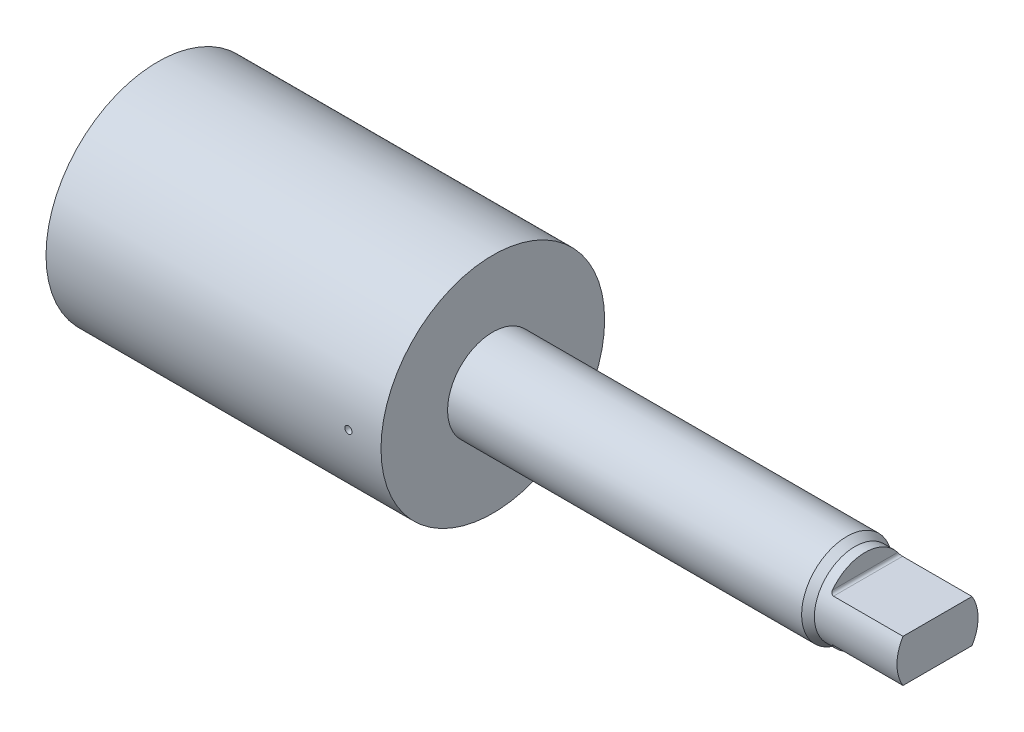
ISO-10303-21;
HEADER;
FILE_DESCRIPTION(('STEP AP214'),'2;1');
FILE_NAME('part.step','',(''),(''),'','','');
FILE_SCHEMA(('AUTOMOTIVE_DESIGN { 1 0 10303 214 1 1 1 1 }'));
ENDSEC;
DATA;
#1=APPLICATION_CONTEXT('core data for automotive mechanical design processes');
#2=APPLICATION_PROTOCOL_DEFINITION('international standard','automotive_design',2000,#1);
#3=PRODUCT_CONTEXT('',#1,'mechanical');
#4=PRODUCT('Part','Part','',(#3));
#5=PRODUCT_RELATED_PRODUCT_CATEGORY('part','',(#4));
#6=PRODUCT_DEFINITION_FORMATION('','',#4);
#7=PRODUCT_DEFINITION_CONTEXT('part definition',#1,'design');
#8=PRODUCT_DEFINITION('design','',#6,#7);
#9=PRODUCT_DEFINITION_SHAPE('','',#8);
#10=(LENGTH_UNIT() NAMED_UNIT(*) SI_UNIT(.MILLI.,.METRE.));
#11=(NAMED_UNIT(*) PLANE_ANGLE_UNIT() SI_UNIT($,.RADIAN.));
#12=(NAMED_UNIT(*) SI_UNIT($,.STERADIAN.) SOLID_ANGLE_UNIT());
#13=UNCERTAINTY_MEASURE_WITH_UNIT(LENGTH_MEASURE(1.E-05),#10,'distance_accuracy_value','');
#14=(GEOMETRIC_REPRESENTATION_CONTEXT(3) GLOBAL_UNCERTAINTY_ASSIGNED_CONTEXT((#13)) GLOBAL_UNIT_ASSIGNED_CONTEXT((#10,
#11,#12)) REPRESENTATION_CONTEXT('',''));
#15=CARTESIAN_POINT('',(0.,0.,0.));
#16=DIRECTION('',(0.,0.,1.));
#17=DIRECTION('',(1.,0.,0.));
#18=AXIS2_PLACEMENT_3D('',#15,#16,#17);
#19=CARTESIAN_POINT('',(26.83,5.9944,0.));
#20=DIRECTION('',(1.,0.,0.));
#21=DIRECTION('',(0.,0.,-1.));
#22=AXIS2_PLACEMENT_3D('',#19,#20,#21);
#23=PLANE('',#22);
#24=CARTESIAN_POINT('',(26.83,0.,0.));
#25=DIRECTION('',(-1.,0.,0.));
#26=DIRECTION('',(0.,0.,1.));
#27=AXIS2_PLACEMENT_3D('',#24,#25,#26);
#28=CIRCLE('',#27,5.9944);
#29=CARTESIAN_POINT('',(26.83,0.,5.9944));
#30=VERTEX_POINT('',#29);
#31=EDGE_CURVE('E148',#30,#30,#28,.T.);
#32=ORIENTED_EDGE('',*,*,#31,.T.);
#33=EDGE_LOOP('',(#32));
#34=FACE_BOUND('',#33,.T.);
#35=ADVANCED_FACE('F36',(#34),#23,.F.);
#36=CARTESIAN_POINT('',(-2.97183620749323,0.,0.));
#37=DIRECTION('',(-1.,0.,0.));
#38=DIRECTION('',(0.,0.,1.));
#39=AXIS2_PLACEMENT_3D('',#36,#37,#38);
#40=CYLINDRICAL_SURFACE('',#39,5.9944);
#41=ORIENTED_EDGE('',*,*,#31,.F.);
#42=CARTESIAN_POINT('',(26.83,0.,5.9944));
#43=CARTESIAN_POINT('',(26.8299992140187,0.0178207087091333,5.99439988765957));
#44=CARTESIAN_POINT('',(26.8284945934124,0.0356540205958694,5.99431968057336));
#45=CARTESIAN_POINT('',(26.8225137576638,0.0708285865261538,5.9940074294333));
#46=CARTESIAN_POINT('',(26.818034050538,0.0881692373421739,5.99377520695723));
#47=CARTESIAN_POINT('',(26.8062317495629,0.121843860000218,5.99318520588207));
#48=CARTESIAN_POINT('',(26.7989106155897,0.138178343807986,5.99282749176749));
#49=CARTESIAN_POINT('',(26.7816355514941,0.169382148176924,5.99202678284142));
#50=CARTESIAN_POINT('',(26.7716822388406,0.184251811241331,5.99158380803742));
#51=CARTESIAN_POINT('',(26.7494130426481,0.212124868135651,5.99066184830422));
#52=CARTESIAN_POINT('',(26.7370948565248,0.225126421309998,5.99018282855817));
#53=CARTESIAN_POINT('',(26.7104502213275,0.248878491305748,5.98924306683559));
#54=CARTESIAN_POINT('',(26.6961236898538,0.259628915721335,5.98878232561));
#55=CARTESIAN_POINT('',(26.6658591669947,0.27857880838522,5.98793082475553));
#56=CARTESIAN_POINT('',(26.6499202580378,0.286776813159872,5.98754010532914));
#57=CARTESIAN_POINT('',(26.6168898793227,0.300379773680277,5.98687314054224));
#58=CARTESIAN_POINT('',(26.5997984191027,0.305784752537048,5.98659689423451));
#59=CARTESIAN_POINT('',(26.5649652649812,0.313643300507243,5.98619034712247));
#60=CARTESIAN_POINT('',(26.5472242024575,0.316099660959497,5.98605990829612));
#61=CARTESIAN_POINT('',(26.5115811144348,0.317999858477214,5.98595927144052));
#62=CARTESIAN_POINT('',(26.4936790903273,0.317443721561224,5.98598907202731));
#63=CARTESIAN_POINT('',(26.4582412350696,0.313337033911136,5.98620542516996));
#64=CARTESIAN_POINT('',(26.4407050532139,0.309789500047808,5.98639181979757));
#65=CARTESIAN_POINT('',(26.4064774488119,0.299805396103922,5.986900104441));
#66=CARTESIAN_POINT('',(26.3897860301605,0.293368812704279,5.98722199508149));
#67=CARTESIAN_POINT('',(26.3577120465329,0.277785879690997,5.98796517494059));
#68=CARTESIAN_POINT('',(26.3423301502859,0.26863815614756,5.98838651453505));
#69=CARTESIAN_POINT('',(26.3133191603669,0.247893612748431,5.98928105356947));
#70=CARTESIAN_POINT('',(26.2996900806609,0.236296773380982,5.98975425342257));
#71=CARTESIAN_POINT('',(26.2745540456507,0.210966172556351,5.99069988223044));
#72=CARTESIAN_POINT('',(26.2630497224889,0.197229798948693,5.99117230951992));
#73=CARTESIAN_POINT('',(26.2425100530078,0.168019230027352,5.99206258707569));
#74=CARTESIAN_POINT('',(26.2334747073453,0.152545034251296,5.99248043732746));
#75=CARTESIAN_POINT('',(26.2181297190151,0.120296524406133,5.99321449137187));
#76=CARTESIAN_POINT('',(26.2118201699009,0.103522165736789,5.99353069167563));
#77=CARTESIAN_POINT('',(26.2021076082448,0.0691501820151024,5.9940257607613));
#78=CARTESIAN_POINT('',(26.1987045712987,0.0515525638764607,5.99420463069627));
#79=CARTESIAN_POINT('',(26.1949048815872,0.0160564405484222,5.99440473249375));
#80=CARTESIAN_POINT('',(26.1945045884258,-0.00184167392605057,5.99442615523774));
#81=CARTESIAN_POINT('',(26.1967122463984,-0.037450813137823,5.9943094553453));
#82=CARTESIAN_POINT('',(26.199320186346,-0.0551618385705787,5.99417133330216));
#83=CARTESIAN_POINT('',(26.2074672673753,-0.0898838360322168,5.9937512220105));
#84=CARTESIAN_POINT('',(26.2130047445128,-0.106895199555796,5.99346931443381));
#85=CARTESIAN_POINT('',(26.2268520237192,-0.139747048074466,5.9927933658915));
#86=CARTESIAN_POINT('',(26.2351618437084,-0.155587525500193,5.99239932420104));
#87=CARTESIAN_POINT('',(26.2543272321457,-0.185664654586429,5.99154294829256));
#88=CARTESIAN_POINT('',(26.2651852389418,-0.1998997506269,5.99108054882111));
#89=CARTESIAN_POINT('',(26.2891352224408,-0.226346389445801,5.99013974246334));
#90=CARTESIAN_POINT('',(26.3022272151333,-0.238557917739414,5.98966133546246));
#91=CARTESIAN_POINT('',(26.3302892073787,-0.26062305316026,5.98874188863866));
#92=CARTESIAN_POINT('',(26.3452610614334,-0.270474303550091,5.98830088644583));
#93=CARTESIAN_POINT('',(26.3766484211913,-0.287523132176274,5.98750657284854));
#94=CARTESIAN_POINT('',(26.3930639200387,-0.294720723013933,5.98715326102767));
#95=CARTESIAN_POINT('',(26.4268638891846,-0.306253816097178,5.98657443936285));
#96=CARTESIAN_POINT('',(26.4442478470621,-0.31059081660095,5.98634886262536));
#97=CARTESIAN_POINT('',(26.4794984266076,-0.316284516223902,5.98605076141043));
#98=CARTESIAN_POINT('',(26.4973650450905,-0.317641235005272,5.98597823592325));
#99=CARTESIAN_POINT('',(26.5330503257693,-0.3173356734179,5.98599444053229));
#100=CARTESIAN_POINT('',(26.5508690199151,-0.315677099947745,5.98608297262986));
#101=CARTESIAN_POINT('',(26.5859745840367,-0.30939570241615,5.98641089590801));
#102=CARTESIAN_POINT('',(26.6032614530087,-0.30477287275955,5.98665028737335));
#103=CARTESIAN_POINT('',(26.6368133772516,-0.292694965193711,5.98725290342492));
#104=CARTESIAN_POINT('',(26.6530784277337,-0.285239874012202,5.98761612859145));
#105=CARTESIAN_POINT('',(26.6841263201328,-0.267709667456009,5.98842546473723));
#106=CARTESIAN_POINT('',(26.6989092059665,-0.257634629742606,5.98887157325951));
#107=CARTESIAN_POINT('',(26.7265917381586,-0.235137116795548,5.98979702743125));
#108=CARTESIAN_POINT('',(26.7394892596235,-0.22271202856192,5.99027640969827));
#109=CARTESIAN_POINT('',(26.7630194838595,-0.195869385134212,5.99121410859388));
#110=CARTESIAN_POINT('',(26.7736516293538,-0.181451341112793,5.99167242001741));
#111=CARTESIAN_POINT('',(26.792354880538,-0.151019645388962,5.9925166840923));
#112=CARTESIAN_POINT('',(26.8004233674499,-0.135004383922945,5.99290256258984));
#113=CARTESIAN_POINT('',(26.8137472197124,-0.101856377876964,5.99355739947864));
#114=CARTESIAN_POINT('',(26.8190059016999,-0.0847249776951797,5.9938264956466));
#115=CARTESIAN_POINT('',(26.8251842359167,-0.0562395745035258,5.99414641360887));
#116=CARTESIAN_POINT('',(26.8269878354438,-0.0450699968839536,5.9942410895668));
#117=CARTESIAN_POINT('',(26.8293959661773,-0.0226019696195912,5.99436791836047));
#118=CARTESIAN_POINT('',(26.8300004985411,-0.0113035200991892,5.99440007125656));
#119=CARTESIAN_POINT('',(26.83,0.,5.9944));
#120=B_SPLINE_CURVE_WITH_KNOTS('',3,(#42,#43,#44,#45,#46,#47,#48,#49,#50,#51,#52,#53,#54,#55,
#56,#57,#58,#59,#60,#61,#62,#63,#64,#65,#66,#67,#68,#69,#70,#71,#72,#73,#74,#75,#76,#77,#78,#79,
#80,#81,#82,#83,#84,#85,#86,#87,#88,#89,#90,#91,#92,#93,#94,#95,#96,#97,#98,#99,#100,#101,#102,
#103,#104,#105,#106,#107,#108,#109,#110,#111,#112,#113,#114,#115,#116,#117,#118,#119),
.UNSPECIFIED.,.T.,.F.,(4,2,2,2,2,2,2,2,2,2,2,2,2,2,2,2,2,2,2,2,2,2,2,2,2,2,2,2,2,2,2,2,2,2,2,2,
2,2,4),(0.,0.0534208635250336,0.10690454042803,0.160360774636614,0.21380447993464,
0.26730048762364,0.320798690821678,0.374327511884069,0.427855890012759,0.481333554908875,
0.534810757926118,0.588234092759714,0.641657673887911,0.695108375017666,0.748559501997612,
0.802076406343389,0.855593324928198,0.90911208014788,0.962630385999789,1.01608379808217,
1.0695370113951,1.12295989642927,1.17638312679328,1.2298576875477,1.28333263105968,
1.33686074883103,1.39038861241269,1.443888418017,1.49738787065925,1.5508215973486,
1.60425542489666,1.65768950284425,1.71112199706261,1.76461425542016,1.8181196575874,
1.8716795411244,1.92517606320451,1.95906048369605,1.99294487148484),.UNSPECIFIED.);
#121=EDGE_CURVE('E54',#30,#30,#120,.T.);
#122=ORIENTED_EDGE('',*,*,#121,.T.);
#123=EDGE_LOOP('',(#41,#122));
#124=FACE_BOUND('',#123,.T.);
#125=CARTESIAN_POINT('',(0.,0.,0.));
#126=DIRECTION('',(-1.,0.,0.));
#127=DIRECTION('',(0.,0.,1.));
#128=AXIS2_PLACEMENT_3D('',#125,#126,#127);
#129=CIRCLE('',#128,5.9944);
#130=CARTESIAN_POINT('',(0.,0.,5.9944));
#131=VERTEX_POINT('',#130);
#132=EDGE_CURVE('E145',#131,#131,#129,.T.);
#133=ORIENTED_EDGE('',*,*,#132,.T.);
#134=EDGE_LOOP('',(#133));
#135=FACE_BOUND('',#134,.T.);
#136=ADVANCED_FACE('F182',(#124,#135),#40,.F.);
#137=CARTESIAN_POINT('',(0.,9.8044,0.));
#138=DIRECTION('',(1.,0.,0.));
#139=DIRECTION('',(0.,0.,-1.));
#140=AXIS2_PLACEMENT_3D('',#137,#138,#139);
#141=PLANE('',#140);
#142=ORIENTED_EDGE('',*,*,#132,.F.);
#143=EDGE_LOOP('',(#142));
#144=FACE_BOUND('',#143,.T.);
#145=CARTESIAN_POINT('',(0.,0.,0.));
#146=DIRECTION('',(-1.,0.,0.));
#147=DIRECTION('',(0.,0.,1.));
#148=AXIS2_PLACEMENT_3D('',#145,#146,#147);
#149=CIRCLE('',#148,9.8044);
#150=CARTESIAN_POINT('',(0.,0.,9.8044));
#151=VERTEX_POINT('',#150);
#152=EDGE_CURVE('E142',#151,#151,#149,.T.);
#153=ORIENTED_EDGE('',*,*,#152,.T.);
#154=EDGE_LOOP('',(#153));
#155=FACE_BOUND('',#154,.T.);
#156=ADVANCED_FACE('F186',(#144,#155),#141,.F.);
#157=CARTESIAN_POINT('',(-2.97183620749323,0.,0.));
#158=DIRECTION('',(-1.,0.,0.));
#159=DIRECTION('',(0.,0.,1.));
#160=AXIS2_PLACEMENT_3D('',#157,#158,#159);
#161=CYLINDRICAL_SURFACE('',#160,9.8044);
#162=CARTESIAN_POINT('',(26.83,0.,9.8044));
#163=CARTESIAN_POINT('',(26.8299992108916,-0.0178290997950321,9.8043999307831));
#164=CARTESIAN_POINT('',(26.8284931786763,-0.0356710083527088,9.80435084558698));
#165=CARTESIAN_POINT('',(26.8225064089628,-0.0708631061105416,9.80415975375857));
#166=CARTESIAN_POINT('',(26.8180221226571,-0.0882126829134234,9.80401763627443));
#167=CARTESIAN_POINT('',(26.806206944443,-0.121905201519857,9.80365657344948));
#168=CARTESIAN_POINT('',(26.7988774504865,-0.138248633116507,9.80343766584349));
#169=CARTESIAN_POINT('',(26.7815819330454,-0.169468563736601,9.80294771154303));
#170=CARTESIAN_POINT('',(26.771616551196,-0.184345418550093,9.80267667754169));
#171=CARTESIAN_POINT('',(26.7493262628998,-0.212222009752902,9.80211283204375));
#172=CARTESIAN_POINT('',(26.7370003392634,-0.22522093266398,9.80182001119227));
#173=CARTESIAN_POINT('',(26.7103406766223,-0.248965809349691,9.80124567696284));
#174=CARTESIAN_POINT('',(26.6960068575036,-0.259711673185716,9.80096416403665));
#175=CARTESIAN_POINT('',(26.6657350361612,-0.278646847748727,9.80044414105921));
#176=CARTESIAN_POINT('',(26.6497967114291,-0.286835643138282,9.80020563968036));
#177=CARTESIAN_POINT('',(26.6167706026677,-0.300420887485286,9.79979862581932));
#178=CARTESIAN_POINT('',(26.5996828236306,-0.305817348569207,9.79963011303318));
#179=CARTESIAN_POINT('',(26.5648492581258,-0.313662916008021,9.79938214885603));
#180=CARTESIAN_POINT('',(26.547103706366,-0.316113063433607,9.79930266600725));
#181=CARTESIAN_POINT('',(26.5114530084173,-0.317999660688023,9.7992416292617));
#182=CARTESIAN_POINT('',(26.4935478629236,-0.317436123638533,9.79926007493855));
#183=CARTESIAN_POINT('',(26.4580933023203,-0.313312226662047,9.79939278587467));
#184=CARTESIAN_POINT('',(26.4405437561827,-0.309752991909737,9.79950701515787));
#185=CARTESIAN_POINT('',(26.4062913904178,-0.299740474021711,9.79981835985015));
#186=CARTESIAN_POINT('',(26.3895885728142,-0.293287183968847,9.80001547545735));
#187=CARTESIAN_POINT('',(26.3575001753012,-0.277668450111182,9.80047041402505));
#188=CARTESIAN_POINT('',(26.3421148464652,-0.268502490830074,9.80072824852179));
#189=CARTESIAN_POINT('',(26.3131009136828,-0.247718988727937,9.8012755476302));
#190=CARTESIAN_POINT('',(26.2994723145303,-0.236101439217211,9.80156501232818));
#191=CARTESIAN_POINT('',(26.274352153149,-0.210738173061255,9.80214310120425));
#192=CARTESIAN_POINT('',(26.2628615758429,-0.196991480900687,9.80243172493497));
#193=CARTESIAN_POINT('',(26.2423512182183,-0.167763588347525,9.80297546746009));
#194=CARTESIAN_POINT('',(26.2333314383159,-0.152282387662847,9.80323058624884));
#195=CARTESIAN_POINT('',(26.2180188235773,-0.120024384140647,9.80367856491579));
#196=CARTESIAN_POINT('',(26.2117260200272,-0.103247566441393,9.8038714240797));
#197=CARTESIAN_POINT('',(26.2020466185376,-0.0688748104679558,9.80417313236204));
#198=CARTESIAN_POINT('',(26.1986600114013,-0.0512788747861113,9.80428198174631));
#199=CARTESIAN_POINT('',(26.1948903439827,-0.0157759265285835,9.8044033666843));
#200=CARTESIAN_POINT('',(26.194505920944,0.00213094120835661,9.80441594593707));
#201=CARTESIAN_POINT('',(26.1967479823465,0.0377549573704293,9.80434348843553));
#202=CARTESIAN_POINT('',(26.1993744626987,0.0554721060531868,9.8042584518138));
#203=CARTESIAN_POINT('',(26.207562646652,0.0902099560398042,9.80400037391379));
#204=CARTESIAN_POINT('',(26.2131237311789,0.107230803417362,9.80382735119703));
#205=CARTESIAN_POINT('',(26.2270226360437,0.140097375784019,9.80341279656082));
#206=CARTESIAN_POINT('',(26.2353604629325,0.155943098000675,9.80317126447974));
#207=CARTESIAN_POINT('',(26.2545796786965,0.186015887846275,9.80264678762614));
#208=CARTESIAN_POINT('',(26.2654619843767,0.200242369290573,9.80236382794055));
#209=CARTESIAN_POINT('',(26.2894599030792,0.226666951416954,9.80178843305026));
#210=CARTESIAN_POINT('',(26.3025755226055,0.238865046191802,9.80149599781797));
#211=CARTESIAN_POINT('',(26.3306736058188,0.260891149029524,9.80093449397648));
#212=CARTESIAN_POINT('',(26.3456567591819,0.270718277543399,9.80066543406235));
#213=CARTESIAN_POINT('',(26.3770610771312,0.287717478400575,9.80018115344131));
#214=CARTESIAN_POINT('',(26.3934822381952,0.294889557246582,9.79996593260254));
#215=CARTESIAN_POINT('',(26.4272931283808,0.306373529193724,9.79961365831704));
#216=CARTESIAN_POINT('',(26.4446826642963,0.310685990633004,9.79947658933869));
#217=CARTESIAN_POINT('',(26.4799394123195,0.316330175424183,9.79929602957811));
#218=CARTESIAN_POINT('',(26.4978066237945,0.317661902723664,9.79925253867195));
#219=CARTESIAN_POINT('',(26.5335027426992,0.317306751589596,9.799264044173));
#220=CARTESIAN_POINT('',(26.5513316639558,0.315621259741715,9.79931899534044));
#221=CARTESIAN_POINT('',(26.5864533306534,0.309282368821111,9.79952109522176));
#222=CARTESIAN_POINT('',(26.6037460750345,0.304628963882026,9.79966824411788));
#223=CARTESIAN_POINT('',(26.6373049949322,0.292486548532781,9.80003814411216));
#224=CARTESIAN_POINT('',(26.6535711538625,0.284997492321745,9.80026089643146));
#225=CARTESIAN_POINT('',(26.6846149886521,0.267396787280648,9.80075688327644));
#226=CARTESIAN_POINT('',(26.6993927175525,0.257285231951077,9.80103011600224));
#227=CARTESIAN_POINT('',(26.7270466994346,0.234722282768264,9.80159639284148));
#228=CARTESIAN_POINT('',(26.7399222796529,0.222270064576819,9.80188944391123));
#229=CARTESIAN_POINT('',(26.7634037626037,0.195377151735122,9.80246232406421));
#230=CARTESIAN_POINT('',(26.7740091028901,0.180935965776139,9.80274214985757));
#231=CARTESIAN_POINT('',(26.7926511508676,0.150468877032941,9.80325714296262));
#232=CARTESIAN_POINT('',(26.8006861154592,0.134441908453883,9.80349227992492));
#233=CARTESIAN_POINT('',(26.8139418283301,0.101278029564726,9.80389085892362));
#234=CARTESIAN_POINT('',(26.8191659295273,0.0841424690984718,9.80405438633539));
#235=CARTESIAN_POINT('',(26.8252685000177,0.0557490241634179,9.80424765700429));
#236=CARTESIAN_POINT('',(26.8270405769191,0.0446754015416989,9.80430453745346));
#237=CARTESIAN_POINT('',(26.8294065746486,0.0224028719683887,9.8043807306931));
#238=CARTESIAN_POINT('',(26.8300004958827,0.011203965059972,9.80440004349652));
#239=CARTESIAN_POINT('',(26.83,0.,9.8044));
#240=B_SPLINE_CURVE_WITH_KNOTS('',3,(#162,#163,#164,#165,#166,#167,#168,#169,#170,#171,#172,
#173,#174,#175,#176,#177,#178,#179,#180,#181,#182,#183,#184,#185,#186,#187,#188,#189,#190,#191,
#192,#193,#194,#195,#196,#197,#198,#199,#200,#201,#202,#203,#204,#205,#206,#207,#208,#209,#210,
#211,#212,#213,#214,#215,#216,#217,#218,#219,#220,#221,#222,#223,#224,#225,#226,#227,#228,#229,
#230,#231,#232,#233,#234,#235,#236,#237,#238,#239),.UNSPECIFIED.,.T.,.F.,(4,2,2,2,2,2,2,2,2,2,2,
2,2,2,2,2,2,2,2,2,2,2,2,2,2,2,2,2,2,2,2,2,2,2,2,2,2,2,4),(0.,0.0534464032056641,
0.106956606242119,0.160440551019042,0.213911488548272,0.267405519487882,0.320901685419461,
0.374408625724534,0.427915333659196,0.481403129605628,0.534890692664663,0.58835817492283,
0.641825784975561,0.6953035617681,0.74878148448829,0.802283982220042,0.855786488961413,
0.909289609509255,0.962792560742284,1.01627122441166,1.06974981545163,1.12321712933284,
1.17668456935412,1.23017130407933,1.28365819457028,1.33716489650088,1.39067146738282,
1.4441674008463,1.49766326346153,1.5511345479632,1.60460593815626,1.65807819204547,
1.71154853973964,1.76503775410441,1.81854020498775,1.87207886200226,1.92555351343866,
1.95913972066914,1.99272591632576),.UNSPECIFIED.);
#241=CARTESIAN_POINT('',(26.83,0.,9.8044));
#242=VERTEX_POINT('',#241);
#243=EDGE_CURVE('E108',#242,#242,#240,.T.);
#244=ORIENTED_EDGE('',*,*,#243,.T.);
#245=EDGE_LOOP('',(#244));
#246=FACE_BOUND('',#245,.T.);
#247=ORIENTED_EDGE('',*,*,#152,.F.);
#248=EDGE_LOOP('',(#247));
#249=FACE_BOUND('',#248,.T.);
#250=CARTESIAN_POINT('',(29.37,0.,0.));
#251=DIRECTION('',(-1.,0.,0.));
#252=DIRECTION('',(0.,0.,1.));
#253=AXIS2_PLACEMENT_3D('',#250,#251,#252);
#254=CIRCLE('',#253,9.8044);
#255=CARTESIAN_POINT('',(29.37,0.,9.8044));
#256=VERTEX_POINT('',#255);
#257=EDGE_CURVE('E139',#256,#256,#254,.T.);
#258=ORIENTED_EDGE('',*,*,#257,.T.);
#259=EDGE_LOOP('',(#258));
#260=FACE_BOUND('',#259,.T.);
#261=ADVANCED_FACE('F190',(#246,#249,#260),#161,.T.);
#262=CARTESIAN_POINT('',(29.37,3.96621,0.));
#263=DIRECTION('',(-1.,0.,0.));
#264=DIRECTION('',(0.,0.,1.));
#265=AXIS2_PLACEMENT_3D('',#262,#263,#264);
#266=PLANE('',#265);
#267=ORIENTED_EDGE('',*,*,#257,.F.);
#268=EDGE_LOOP('',(#267));
#269=FACE_BOUND('',#268,.T.);
#270=CARTESIAN_POINT('',(29.37,0.,0.));
#271=DIRECTION('',(-1.,0.,0.));
#272=DIRECTION('',(0.,0.,1.));
#273=AXIS2_PLACEMENT_3D('',#270,#271,#272);
#274=CIRCLE('',#273,3.96621);
#275=CARTESIAN_POINT('',(29.37,0.,3.96621));
#276=VERTEX_POINT('',#275);
#277=EDGE_CURVE('E136',#276,#276,#274,.T.);
#278=ORIENTED_EDGE('',*,*,#277,.T.);
#279=EDGE_LOOP('',(#278));
#280=FACE_BOUND('',#279,.T.);
#281=ADVANCED_FACE('F195',(#269,#280),#266,.F.);
#282=CARTESIAN_POINT('',(-2.97183620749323,0.,0.));
#283=DIRECTION('',(-1.,0.,0.));
#284=DIRECTION('',(0.,0.,1.));
#285=AXIS2_PLACEMENT_3D('',#282,#283,#284);
#286=CYLINDRICAL_SURFACE('',#285,3.96621);
#287=ORIENTED_EDGE('',*,*,#277,.F.);
#288=EDGE_LOOP('',(#287));
#289=FACE_BOUND('',#288,.T.);
#290=CARTESIAN_POINT('',(60.4094954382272,0.,0.));
#291=DIRECTION('',(-1.,0.,0.));
#292=DIRECTION('',(0.,0.,1.));
#293=AXIS2_PLACEMENT_3D('',#290,#291,#292);
#294=CIRCLE('',#293,3.96621);
#295=CARTESIAN_POINT('',(60.4094954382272,0.,3.96621));
#296=VERTEX_POINT('',#295);
#297=EDGE_CURVE('E133',#296,#296,#294,.T.);
#298=ORIENTED_EDGE('',*,*,#297,.T.);
#299=EDGE_LOOP('',(#298));
#300=FACE_BOUND('',#299,.T.);
#301=ADVANCED_FACE('F235',(#289,#300),#286,.T.);
#302=CARTESIAN_POINT('',(61.12,0.,0.));
#303=DIRECTION('',(-1.,0.,0.));
#304=DIRECTION('',(0.,0.,1.));
#305=AXIS2_PLACEMENT_3D('',#302,#303,#304);
#306=CONICAL_SURFACE('',#305,3.556,0.523598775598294);
#307=ORIENTED_EDGE('',*,*,#297,.F.);
#308=EDGE_LOOP('',(#307));
#309=FACE_BOUND('',#308,.T.);
#310=CARTESIAN_POINT('',(61.12,0.,0.));
#311=DIRECTION('',(-1.,0.,0.));
#312=DIRECTION('',(0.,0.,1.));
#313=AXIS2_PLACEMENT_3D('',#310,#311,#312);
#314=CIRCLE('',#313,3.556);
#315=CARTESIAN_POINT('',(61.12,0.,3.556));
#316=VERTEX_POINT('',#315);
#317=EDGE_CURVE('E126',#316,#316,#314,.T.);
#318=ORIENTED_EDGE('',*,*,#317,.T.);
#319=EDGE_LOOP('',(#318));
#320=FACE_BOUND('',#319,.T.);
#321=ADVANCED_FACE('F230',(#309,#320),#306,.T.);
#322=CARTESIAN_POINT('',(-2.97183620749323,0.,0.));
#323=DIRECTION('',(-1.,0.,0.));
#324=DIRECTION('',(0.,0.,1.));
#325=AXIS2_PLACEMENT_3D('',#322,#323,#324);
#326=CYLINDRICAL_SURFACE('',#325,3.556);
#327=ORIENTED_EDGE('',*,*,#317,.F.);
#328=EDGE_LOOP('',(#327));
#329=FACE_BOUND('',#328,.T.);
#330=CARTESIAN_POINT('',(68.359,0.,0.));
#331=DIRECTION('',(-1.,0.,0.));
#332=DIRECTION('',(0.,0.,1.));
#333=AXIS2_PLACEMENT_3D('',#330,#331,#332);
#334=CIRCLE('',#333,3.556);
#335=CARTESIAN_POINT('',(68.359,1.8669,-3.02651951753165));
#336=VERTEX_POINT('',#335);
#337=CARTESIAN_POINT('',(68.359,-1.8669,-3.02651951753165));
#338=VERTEX_POINT('',#337);
#339=EDGE_CURVE('E123',#336,#338,#334,.T.);
#340=ORIENTED_EDGE('',*,*,#339,.T.);
#341=DIRECTION('',(-1.,0.,0.));
#342=VECTOR('',#341,1.);
#343=CARTESIAN_POINT('',(-2.97183620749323,-1.8669,-3.02651951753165));
#344=LINE('',#343,#342);
#345=CARTESIAN_POINT('',(62.263,-1.8669,-3.02651951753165));
#346=VERTEX_POINT('',#345);
#347=EDGE_CURVE('E107',#338,#346,#344,.T.);
#348=ORIENTED_EDGE('',*,*,#347,.T.);
#349=CARTESIAN_POINT('',(62.263,-1.8669,-3.02651951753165));
#350=CARTESIAN_POINT('',(62.2502882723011,-1.8668827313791,-3.02652784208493));
#351=CARTESIAN_POINT('',(62.237590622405,-1.86785304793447,-3.0259316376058));
#352=CARTESIAN_POINT('',(62.2126336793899,-1.87163025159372,-3.02359798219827));
#353=CARTESIAN_POINT('',(62.2003727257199,-1.87442916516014,-3.02186548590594));
#354=CARTESIAN_POINT('',(62.1765927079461,-1.88172415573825,-3.01732785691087));
#355=CARTESIAN_POINT('',(62.1650730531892,-1.88621886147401,-3.0145235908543));
#356=CARTESIAN_POINT('',(62.1430222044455,-1.89668951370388,-3.00794668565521));
#357=CARTESIAN_POINT('',(62.1324917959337,-1.90266662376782,-3.00417328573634));
#358=CARTESIAN_POINT('',(62.112118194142,-1.91618654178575,-2.99556876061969));
#359=CARTESIAN_POINT('',(62.102335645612,-1.92379266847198,-2.99069419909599));
#360=CARTESIAN_POINT('',(62.0842024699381,-1.94007925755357,-2.98015479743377));
#361=CARTESIAN_POINT('',(62.0758522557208,-1.94876002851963,-2.97448973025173));
#362=CARTESIAN_POINT('',(62.0595825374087,-1.96819305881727,-2.96167272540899));
#363=CARTESIAN_POINT('',(62.0518837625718,-1.97906559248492,-2.9544235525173));
#364=CARTESIAN_POINT('',(62.0384190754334,-2.00152188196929,-2.93925673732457));
#365=CARTESIAN_POINT('',(62.0326549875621,-2.01310629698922,-2.93133847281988));
#366=CARTESIAN_POINT('',(62.0222068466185,-2.03870024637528,-2.91360922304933));
#367=CARTESIAN_POINT('',(62.0178723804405,-2.05278756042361,-2.90370515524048));
#368=CARTESIAN_POINT('',(62.0117101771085,-2.08115270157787,-2.88344283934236));
#369=CARTESIAN_POINT('',(62.0098795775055,-2.09543029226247,-2.87308512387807));
#370=CARTESIAN_POINT('',(62.0090827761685,-2.11340583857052,-2.85983810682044));
#371=CARTESIAN_POINT('',(62.009000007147,-2.11715635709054,-2.85706273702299));
#372=CARTESIAN_POINT('',(62.009,-2.1209,-2.85428085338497));
#373=B_SPLINE_CURVE_WITH_KNOTS('',3,(#349,#350,#351,#352,#353,#354,#355,#356,#357,#358,#359,
#360,#361,#362,#363,#364,#365,#366,#367,#368,#369,#370,#371,#372),.UNSPECIFIED.,.F.,.F.,(4,2,2,
2,2,2,2,2,2,2,2,4),(0.,0.0380621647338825,0.0759594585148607,0.113826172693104,
0.151722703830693,0.19151314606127,0.23131504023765,0.276642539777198,0.322012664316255,
0.375086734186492,0.428100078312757,0.442095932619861),.UNSPECIFIED.);
#374=CARTESIAN_POINT('',(62.009,-2.1209,-2.85428085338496));
#375=VERTEX_POINT('',#374);
#376=EDGE_CURVE('E167',#346,#375,#373,.T.);
#377=ORIENTED_EDGE('',*,*,#376,.T.);
#378=CARTESIAN_POINT('',(62.009,0.,0.));
#379=DIRECTION('',(-1.,0.,0.));
#380=DIRECTION('',(0.,0.,1.));
#381=AXIS2_PLACEMENT_3D('',#378,#379,#380);
#382=CIRCLE('',#381,3.556);
#383=CARTESIAN_POINT('',(62.009,-2.1209,2.85428085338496));
#384=VERTEX_POINT('',#383);
#385=EDGE_CURVE('E116',#375,#384,#382,.T.);
#386=ORIENTED_EDGE('',*,*,#385,.T.);
#387=CARTESIAN_POINT('',(62.009,-2.1209,2.85428085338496));
#388=CARTESIAN_POINT('',(62.0089971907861,-2.10365588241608,2.86710647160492));
#389=CARTESIAN_POINT('',(62.0107591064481,-2.08623171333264,2.87979912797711));
#390=CARTESIAN_POINT('',(62.0179984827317,-2.05157791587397,2.9045828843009));
#391=CARTESIAN_POINT('',(62.0234981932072,-2.03435008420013,2.91666991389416));
#392=CARTESIAN_POINT('',(62.0367863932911,-2.00449908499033,2.9372397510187));
#393=CARTESIAN_POINT('',(62.0438193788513,-1.99168786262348,2.94593555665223));
#394=CARTESIAN_POINT('',(62.0603092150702,-1.96711298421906,2.96240091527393));
#395=CARTESIAN_POINT('',(62.0697588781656,-1.95534635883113,2.97017311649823));
#396=CARTESIAN_POINT('',(62.0894369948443,-1.93499384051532,2.98346448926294));
#397=CARTESIAN_POINT('',(62.0993351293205,-1.92619567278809,2.98914672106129));
#398=CARTESIAN_POINT('',(62.1207417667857,-1.91004908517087,2.99949003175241));
#399=CARTESIAN_POINT('',(62.1322507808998,-1.90270112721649,3.00415078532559));
#400=CARTESIAN_POINT('',(62.1567195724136,-1.88978722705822,3.01229136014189));
#401=CARTESIAN_POINT('',(62.169688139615,-1.88423295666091,3.01576345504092));
#402=CARTESIAN_POINT('',(62.196629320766,-1.875316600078,3.02131623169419));
#403=CARTESIAN_POINT('',(62.2105999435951,-1.87195029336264,3.02339959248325));
#404=CARTESIAN_POINT('',(62.231109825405,-1.86882855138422,3.02532921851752));
#405=CARTESIAN_POINT('',(62.2374614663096,-1.86810612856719,3.02577526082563));
#406=CARTESIAN_POINT('',(62.2502074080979,-1.86714207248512,3.02637021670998));
#407=CARTESIAN_POINT('',(62.2566016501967,-1.86689987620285,3.02651947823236));
#408=CARTESIAN_POINT('',(62.2629999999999,-1.8668999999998,3.02651951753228));
#409=B_SPLINE_CURVE_WITH_KNOTS('',3,(#387,#388,#389,#390,#391,#392,#393,#394,#395,#396,#397,
#398,#399,#400,#401,#402,#403,#404,#405,#406,#407,#408),.UNSPECIFIED.,.F.,.F.,(4,2,2,2,2,2,2,2,
2,2,4),(0.,0.0645080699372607,0.129403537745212,0.180218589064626,0.230884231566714,
0.273937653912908,0.317004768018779,0.360346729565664,0.403604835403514,0.422808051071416,
0.441988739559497),.UNSPECIFIED.);
#410=CARTESIAN_POINT('',(62.263,-1.8669,3.02651951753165));
#411=VERTEX_POINT('',#410);
#412=EDGE_CURVE('E104',#384,#411,#409,.T.);
#413=ORIENTED_EDGE('',*,*,#412,.T.);
#414=DIRECTION('',(-1.,0.,0.));
#415=VECTOR('',#414,1.);
#416=CARTESIAN_POINT('',(-2.97183620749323,-1.8669,3.02651951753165));
#417=LINE('',#416,#415);
#418=CARTESIAN_POINT('',(68.359,-1.8669,3.02651951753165));
#419=VERTEX_POINT('',#418);
#420=EDGE_CURVE('E95',#411,#419,#417,.F.);
#421=ORIENTED_EDGE('',*,*,#420,.T.);
#422=CARTESIAN_POINT('',(68.359,1.8669,3.02651951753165));
#423=VERTEX_POINT('',#422);
#424=EDGE_CURVE('E101',#419,#423,#334,.T.);
#425=ORIENTED_EDGE('',*,*,#424,.T.);
#426=DIRECTION('',(-1.,0.,0.));
#427=VECTOR('',#426,1.);
#428=CARTESIAN_POINT('',(-2.97183620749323,1.8669,3.02651951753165));
#429=LINE('',#428,#427);
#430=CARTESIAN_POINT('',(62.263,1.8669,3.02651951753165));
#431=VERTEX_POINT('',#430);
#432=EDGE_CURVE('E124',#423,#431,#429,.T.);
#433=ORIENTED_EDGE('',*,*,#432,.T.);
#434=CARTESIAN_POINT('',(62.263,1.8669,3.02651951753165));
#435=CARTESIAN_POINT('',(62.2502882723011,1.8668827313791,3.02652784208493));
#436=CARTESIAN_POINT('',(62.237590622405,1.86785304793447,3.0259316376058));
#437=CARTESIAN_POINT('',(62.2126336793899,1.87163025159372,3.02359798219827));
#438=CARTESIAN_POINT('',(62.2003727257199,1.87442916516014,3.02186548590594));
#439=CARTESIAN_POINT('',(62.1765927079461,1.88172415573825,3.01732785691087));
#440=CARTESIAN_POINT('',(62.1650730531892,1.88621886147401,3.0145235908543));
#441=CARTESIAN_POINT('',(62.1430222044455,1.89668951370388,3.00794668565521));
#442=CARTESIAN_POINT('',(62.1324917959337,1.90266662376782,3.00417328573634));
#443=CARTESIAN_POINT('',(62.112118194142,1.91618654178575,2.99556876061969));
#444=CARTESIAN_POINT('',(62.102335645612,1.92379266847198,2.99069419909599));
#445=CARTESIAN_POINT('',(62.0842024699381,1.94007925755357,2.98015479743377));
#446=CARTESIAN_POINT('',(62.0758522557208,1.94876002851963,2.97448973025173));
#447=CARTESIAN_POINT('',(62.0595825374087,1.96819305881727,2.96167272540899));
#448=CARTESIAN_POINT('',(62.0518837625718,1.97906559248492,2.9544235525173));
#449=CARTESIAN_POINT('',(62.0384190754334,2.00152188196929,2.93925673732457));
#450=CARTESIAN_POINT('',(62.0326549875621,2.01310629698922,2.93133847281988));
#451=CARTESIAN_POINT('',(62.0222068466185,2.03870024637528,2.91360922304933));
#452=CARTESIAN_POINT('',(62.0178723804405,2.05278756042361,2.90370515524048));
#453=CARTESIAN_POINT('',(62.0117101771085,2.08115270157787,2.88344283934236));
#454=CARTESIAN_POINT('',(62.0098795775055,2.09543029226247,2.87308512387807));
#455=CARTESIAN_POINT('',(62.0090827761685,2.11340583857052,2.85983810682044));
#456=CARTESIAN_POINT('',(62.009000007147,2.11715635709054,2.85706273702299));
#457=CARTESIAN_POINT('',(62.009,2.1209,2.85428085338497));
#458=B_SPLINE_CURVE_WITH_KNOTS('',3,(#434,#435,#436,#437,#438,#439,#440,#441,#442,#443,#444,
#445,#446,#447,#448,#449,#450,#451,#452,#453,#454,#455,#456,#457),.UNSPECIFIED.,.F.,.F.,(4,2,2,
2,2,2,2,2,2,2,2,4),(0.,0.0380621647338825,0.0759594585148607,0.113826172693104,
0.151722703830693,0.19151314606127,0.23131504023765,0.276642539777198,0.322012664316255,
0.375086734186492,0.428100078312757,0.442095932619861),.UNSPECIFIED.);
#459=CARTESIAN_POINT('',(62.009,2.1209,2.85428085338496));
#460=VERTEX_POINT('',#459);
#461=EDGE_CURVE('E49',#431,#460,#458,.T.);
#462=ORIENTED_EDGE('',*,*,#461,.T.);
#463=CARTESIAN_POINT('',(62.009,0.,0.));
#464=DIRECTION('',(-1.,0.,0.));
#465=DIRECTION('',(0.,0.,1.));
#466=AXIS2_PLACEMENT_3D('',#463,#464,#465);
#467=CIRCLE('',#466,3.556);
#468=CARTESIAN_POINT('',(62.009,2.1209,-2.85428085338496));
#469=VERTEX_POINT('',#468);
#470=EDGE_CURVE('E117',#460,#469,#467,.T.);
#471=ORIENTED_EDGE('',*,*,#470,.T.);
#472=CARTESIAN_POINT('',(62.009,2.1209,-2.85428085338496));
#473=CARTESIAN_POINT('',(62.0089971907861,2.10365588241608,-2.86710647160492));
#474=CARTESIAN_POINT('',(62.0107591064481,2.08623171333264,-2.87979912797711));
#475=CARTESIAN_POINT('',(62.0179984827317,2.05157791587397,-2.9045828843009));
#476=CARTESIAN_POINT('',(62.0234981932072,2.03435008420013,-2.91666991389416));
#477=CARTESIAN_POINT('',(62.0367863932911,2.00449908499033,-2.9372397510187));
#478=CARTESIAN_POINT('',(62.0438193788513,1.99168786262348,-2.94593555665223));
#479=CARTESIAN_POINT('',(62.0603092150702,1.96711298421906,-2.96240091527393));
#480=CARTESIAN_POINT('',(62.0697588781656,1.95534635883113,-2.97017311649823));
#481=CARTESIAN_POINT('',(62.0894369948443,1.93499384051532,-2.98346448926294));
#482=CARTESIAN_POINT('',(62.0993351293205,1.92619567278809,-2.98914672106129));
#483=CARTESIAN_POINT('',(62.1207417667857,1.91004908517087,-2.99949003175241));
#484=CARTESIAN_POINT('',(62.1322507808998,1.90270112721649,-3.00415078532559));
#485=CARTESIAN_POINT('',(62.1567195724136,1.88978722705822,-3.01229136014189));
#486=CARTESIAN_POINT('',(62.169688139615,1.88423295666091,-3.01576345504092));
#487=CARTESIAN_POINT('',(62.196629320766,1.875316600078,-3.02131623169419));
#488=CARTESIAN_POINT('',(62.2105999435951,1.87195029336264,-3.02339959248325));
#489=CARTESIAN_POINT('',(62.231109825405,1.86882855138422,-3.02532921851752));
#490=CARTESIAN_POINT('',(62.2374614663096,1.86810612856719,-3.02577526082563));
#491=CARTESIAN_POINT('',(62.2502074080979,1.86714207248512,-3.02637021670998));
#492=CARTESIAN_POINT('',(62.2566016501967,1.86689987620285,-3.02651947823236));
#493=CARTESIAN_POINT('',(62.2629999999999,1.8668999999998,-3.02651951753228));
#494=B_SPLINE_CURVE_WITH_KNOTS('',3,(#472,#473,#474,#475,#476,#477,#478,#479,#480,#481,#482,
#483,#484,#485,#486,#487,#488,#489,#490,#491,#492,#493),.UNSPECIFIED.,.F.,.F.,(4,2,2,2,2,2,2,2,
2,2,4),(0.,0.0645080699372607,0.129403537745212,0.180218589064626,0.230884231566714,
0.273937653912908,0.317004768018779,0.360346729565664,0.403604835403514,0.422808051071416,
0.441988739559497),.UNSPECIFIED.);
#495=CARTESIAN_POINT('',(62.263,1.8669,-3.02651951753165));
#496=VERTEX_POINT('',#495);
#497=EDGE_CURVE('E12',#469,#496,#494,.T.);
#498=ORIENTED_EDGE('',*,*,#497,.T.);
#499=DIRECTION('',(-1.,0.,0.));
#500=VECTOR('',#499,1.);
#501=CARTESIAN_POINT('',(-2.97183620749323,1.8669,-3.02651951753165));
#502=LINE('',#501,#500);
#503=EDGE_CURVE('E127',#496,#336,#502,.F.);
#504=ORIENTED_EDGE('',*,*,#503,.T.);
#505=EDGE_LOOP('',(#340,#348,#377,#386,#413,#421,#425,#433,#462,#471,#498,#504));
#506=FACE_BOUND('',#505,.T.);
#507=ADVANCED_FACE('F98',(#329,#506),#326,.T.);
#508=CARTESIAN_POINT('',(68.359,3.556,0.));
#509=DIRECTION('',(-1.,0.,0.));
#510=DIRECTION('',(0.,0.,1.));
#511=AXIS2_PLACEMENT_3D('',#508,#509,#510);
#512=PLANE('',#511);
#513=ORIENTED_EDGE('',*,*,#424,.F.);
#514=DIRECTION('',(0.,0.,-1.));
#515=VECTOR('',#514,1.);
#516=CARTESIAN_POINT('',(68.359,-1.8669,0.));
#517=LINE('',#516,#515);
#518=EDGE_CURVE('E111',#419,#338,#517,.T.);
#519=ORIENTED_EDGE('',*,*,#518,.T.);
#520=ORIENTED_EDGE('',*,*,#339,.F.);
#521=DIRECTION('',(0.,0.,1.));
#522=VECTOR('',#521,1.);
#523=CARTESIAN_POINT('',(68.359,1.8669,0.));
#524=LINE('',#523,#522);
#525=EDGE_CURVE('E122',#336,#423,#524,.T.);
#526=ORIENTED_EDGE('',*,*,#525,.T.);
#527=EDGE_LOOP('',(#513,#519,#520,#526));
#528=FACE_BOUND('',#527,.T.);
#529=ADVANCED_FACE('F120',(#528),#512,.F.);
#530=CARTESIAN_POINT('',(62.009,3.556,-6.35));
#531=DIRECTION('',(-1.,0.,0.));
#532=DIRECTION('',(0.,0.,1.));
#533=AXIS2_PLACEMENT_3D('',#530,#531,#532);
#534=PLANE('',#533);
#535=ORIENTED_EDGE('',*,*,#470,.F.);
#536=DIRECTION('',(0.,0.,1.));
#537=VECTOR('',#536,1.);
#538=CARTESIAN_POINT('',(62.009,2.1209,-3.02651951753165));
#539=LINE('',#538,#537);
#540=EDGE_CURVE('E60',#460,#469,#539,.F.);
#541=ORIENTED_EDGE('',*,*,#540,.T.);
#542=EDGE_LOOP('',(#535,#541));
#543=FACE_BOUND('',#542,.T.);
#544=ADVANCED_FACE('F223',(#543),#534,.F.);
#545=CARTESIAN_POINT('',(62.009,1.8669,-6.35));
#546=DIRECTION('',(0.,-1.,0.));
#547=DIRECTION('',(0.,0.,-1.));
#548=AXIS2_PLACEMENT_3D('',#545,#546,#547);
#549=PLANE('',#548);
#550=ORIENTED_EDGE('',*,*,#503,.F.);
#551=DIRECTION('',(0.,0.,1.));
#552=VECTOR('',#551,1.);
#553=CARTESIAN_POINT('',(62.263,1.8669,3.02651951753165));
#554=LINE('',#553,#552);
#555=EDGE_CURVE('E159',#496,#431,#554,.T.);
#556=ORIENTED_EDGE('',*,*,#555,.T.);
#557=ORIENTED_EDGE('',*,*,#432,.F.);
#558=ORIENTED_EDGE('',*,*,#525,.F.);
#559=EDGE_LOOP('',(#550,#556,#557,#558));
#560=FACE_BOUND('',#559,.T.);
#561=ADVANCED_FACE('F217',(#560),#549,.F.);
#562=CARTESIAN_POINT('',(62.009,-3.556,-6.35));
#563=DIRECTION('',(-1.,0.,0.));
#564=DIRECTION('',(0.,0.,1.));
#565=AXIS2_PLACEMENT_3D('',#562,#563,#564);
#566=PLANE('',#565);
#567=ORIENTED_EDGE('',*,*,#385,.F.);
#568=DIRECTION('',(0.,0.,1.));
#569=VECTOR('',#568,1.);
#570=CARTESIAN_POINT('',(62.009,-2.1209,3.02651951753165));
#571=LINE('',#570,#569);
#572=EDGE_CURVE('E154',#375,#384,#571,.T.);
#573=ORIENTED_EDGE('',*,*,#572,.T.);
#574=EDGE_LOOP('',(#567,#573));
#575=FACE_BOUND('',#574,.T.);
#576=ADVANCED_FACE('F214',(#575),#566,.F.);
#577=CARTESIAN_POINT('',(62.009,-1.8669,-6.35));
#578=DIRECTION('',(0.,1.,0.));
#579=DIRECTION('',(0.,0.,1.));
#580=AXIS2_PLACEMENT_3D('',#577,#578,#579);
#581=PLANE('',#580);
#582=ORIENTED_EDGE('',*,*,#420,.F.);
#583=DIRECTION('',(0.,0.,1.));
#584=VECTOR('',#583,1.);
#585=CARTESIAN_POINT('',(62.263,-1.8669,-3.02651951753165));
#586=LINE('',#585,#584);
#587=EDGE_CURVE('E157',#411,#346,#586,.F.);
#588=ORIENTED_EDGE('',*,*,#587,.T.);
#589=ORIENTED_EDGE('',*,*,#347,.F.);
#590=ORIENTED_EDGE('',*,*,#518,.F.);
#591=EDGE_LOOP('',(#582,#588,#589,#590));
#592=FACE_BOUND('',#591,.T.);
#593=ADVANCED_FACE('F112',(#592),#581,.F.);
#594=CARTESIAN_POINT('',(62.263,-2.1209,-6.35));
#595=DIRECTION('',(0.,0.,-1.));
#596=DIRECTION('',(-1.,0.,0.));
#597=AXIS2_PLACEMENT_3D('',#594,#595,#596);
#598=CYLINDRICAL_SURFACE('',#597,0.254);
#599=ORIENTED_EDGE('',*,*,#376,.F.);
#600=ORIENTED_EDGE('',*,*,#587,.F.);
#601=ORIENTED_EDGE('',*,*,#412,.F.);
#602=ORIENTED_EDGE('',*,*,#572,.F.);
#603=EDGE_LOOP('',(#599,#600,#601,#602));
#604=FACE_BOUND('',#603,.T.);
#605=ADVANCED_FACE('F174',(#604),#598,.F.);
#606=CARTESIAN_POINT('',(62.263,2.1209,-6.35));
#607=DIRECTION('',(0.,0.,-1.));
#608=DIRECTION('',(-1.,0.,0.));
#609=AXIS2_PLACEMENT_3D('',#606,#607,#608);
#610=CYLINDRICAL_SURFACE('',#609,0.254);
#611=ORIENTED_EDGE('',*,*,#497,.F.);
#612=ORIENTED_EDGE('',*,*,#540,.F.);
#613=ORIENTED_EDGE('',*,*,#461,.F.);
#614=ORIENTED_EDGE('',*,*,#555,.F.);
#615=EDGE_LOOP('',(#611,#612,#613,#614));
#616=FACE_BOUND('',#615,.T.);
#617=ADVANCED_FACE('F38',(#616),#610,.F.);
#618=CARTESIAN_POINT('',(26.5125,0.,9.8044));
#619=DIRECTION('',(0.,0.,1.));
#620=DIRECTION('',(1.,0.,0.));
#621=AXIS2_PLACEMENT_3D('',#618,#619,#620);
#622=CYLINDRICAL_SURFACE('',#621,0.317499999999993);
#623=ORIENTED_EDGE('',*,*,#121,.F.);
#624=EDGE_LOOP('',(#623));
#625=FACE_BOUND('',#624,.T.);
#626=ORIENTED_EDGE('',*,*,#243,.F.);
#627=EDGE_LOOP('',(#626));
#628=FACE_BOUND('',#627,.T.);
#629=ADVANCED_FACE('F208',(#625,#628),#622,.F.);
#630=CLOSED_SHELL('',(#35,#136,#156,#261,#281,#301,#321,#507,#529,#544,#561,#576,#593,#605,#617,#629));
#631=MANIFOLD_SOLID_BREP('B2',#630);
#632=ADVANCED_BREP_SHAPE_REPRESENTATION('',(#18,#631),#14);
#633=SHAPE_DEFINITION_REPRESENTATION(#9,#632);
ENDSEC;
END-ISO-10303-21;
